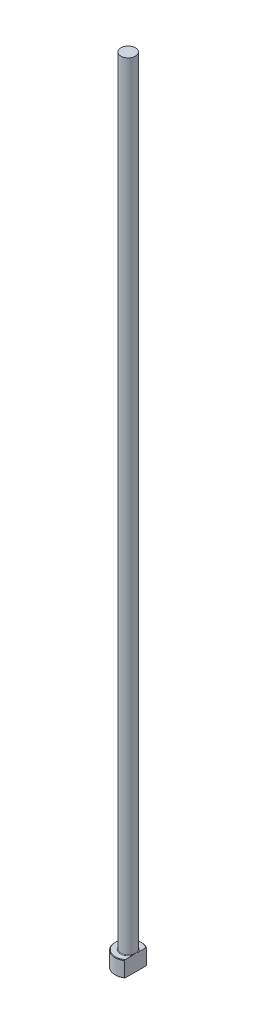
ISO-10303-21;
HEADER;
FILE_DESCRIPTION(('STEP AP214'),'2;1');
FILE_NAME('part.step','',(''),(''),'','','');
FILE_SCHEMA(('AUTOMOTIVE_DESIGN { 1 0 10303 214 1 1 1 1 }'));
ENDSEC;
DATA;
#1=APPLICATION_CONTEXT('core data for automotive mechanical design processes');
#2=APPLICATION_PROTOCOL_DEFINITION('international standard','automotive_design',2000,#1);
#3=PRODUCT_CONTEXT('',#1,'mechanical');
#4=PRODUCT('Part','Part','',(#3));
#5=PRODUCT_RELATED_PRODUCT_CATEGORY('part','',(#4));
#6=PRODUCT_DEFINITION_FORMATION('','',#4);
#7=PRODUCT_DEFINITION_CONTEXT('part definition',#1,'design');
#8=PRODUCT_DEFINITION('design','',#6,#7);
#9=PRODUCT_DEFINITION_SHAPE('','',#8);
#10=(LENGTH_UNIT() NAMED_UNIT(*) SI_UNIT(.MILLI.,.METRE.));
#11=(NAMED_UNIT(*) PLANE_ANGLE_UNIT() SI_UNIT($,.RADIAN.));
#12=(NAMED_UNIT(*) SI_UNIT($,.STERADIAN.) SOLID_ANGLE_UNIT());
#13=UNCERTAINTY_MEASURE_WITH_UNIT(LENGTH_MEASURE(1.E-05),#10,'distance_accuracy_value','');
#14=(GEOMETRIC_REPRESENTATION_CONTEXT(3) GLOBAL_UNCERTAINTY_ASSIGNED_CONTEXT((#13)) GLOBAL_UNIT_ASSIGNED_CONTEXT((#10,
#11,#12)) REPRESENTATION_CONTEXT('',''));
#15=CARTESIAN_POINT('',(0.,0.,0.));
#16=DIRECTION('',(0.,0.,1.));
#17=DIRECTION('',(1.,0.,0.));
#18=AXIS2_PLACEMENT_3D('',#15,#16,#17);
#19=CARTESIAN_POINT('',(0.,0.,0.));
#20=DIRECTION('',(0.,-1.,0.));
#21=DIRECTION('',(0.,0.,-1.));
#22=AXIS2_PLACEMENT_3D('',#19,#20,#21);
#23=PLANE('',#22);
#24=CARTESIAN_POINT('',(0.,0.,0.));
#25=DIRECTION('',(0.,-1.,0.));
#26=DIRECTION('',(0.,0.,-1.));
#27=AXIS2_PLACEMENT_3D('',#24,#25,#26);
#28=CIRCLE('',#27,4.79999999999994);
#29=CARTESIAN_POINT('',(2.74999999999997,0.,3.93414539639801));
#30=VERTEX_POINT('',#29);
#31=CARTESIAN_POINT('',(2.74999999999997,0.,-3.93414539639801));
#32=VERTEX_POINT('',#31);
#33=EDGE_CURVE('E98',#30,#32,#28,.T.);
#34=ORIENTED_EDGE('',*,*,#33,.T.);
#35=DIRECTION('',(0.,0.,1.));
#36=VECTOR('',#35,1.);
#37=CARTESIAN_POINT('',(2.74999999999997,0.,4.1758232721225));
#38=LINE('',#37,#36);
#39=EDGE_CURVE('E83',#32,#30,#38,.T.);
#40=ORIENTED_EDGE('',*,*,#39,.T.);
#41=EDGE_LOOP('',(#34,#40));
#42=FACE_BOUND('',#41,.T.);
#43=ADVANCED_FACE('F32',(#42),#23,.T.);
#44=CARTESIAN_POINT('',(0.,259.958771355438,0.));
#45=DIRECTION('',(0.,1.,0.));
#46=DIRECTION('',(0.,0.,1.));
#47=AXIS2_PLACEMENT_3D('',#44,#45,#46);
#48=CYLINDRICAL_SURFACE('',#47,4.99999999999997);
#49=CARTESIAN_POINT('',(0.,5.79999999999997,0.));
#50=DIRECTION('',(0.,1.,0.));
#51=DIRECTION('',(0.,0.,1.));
#52=AXIS2_PLACEMENT_3D('',#49,#50,#51);
#53=CIRCLE('',#52,4.99999999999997);
#54=CARTESIAN_POINT('',(2.74999999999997,5.79999999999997,4.1758232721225));
#55=VERTEX_POINT('',#54);
#56=CARTESIAN_POINT('',(2.74999999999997,5.79999999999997,-4.1758232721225));
#57=VERTEX_POINT('',#56);
#58=EDGE_CURVE('E104',#55,#57,#53,.F.);
#59=ORIENTED_EDGE('',*,*,#58,.T.);
#60=DIRECTION('',(0.,-1.,0.));
#61=VECTOR('',#60,1.);
#62=CARTESIAN_POINT('',(2.74999999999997,300.,-4.1758232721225));
#63=LINE('',#62,#61);
#64=CARTESIAN_POINT('',(2.74999999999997,0.200000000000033,-4.1758232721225));
#65=VERTEX_POINT('',#64);
#66=EDGE_CURVE('E183',#57,#65,#63,.T.);
#67=ORIENTED_EDGE('',*,*,#66,.T.);
#68=CARTESIAN_POINT('',(0.,0.200000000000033,0.));
#69=DIRECTION('',(0.,-1.,0.));
#70=DIRECTION('',(0.,0.,-1.));
#71=AXIS2_PLACEMENT_3D('',#68,#69,#70);
#72=CIRCLE('',#71,4.99999999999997);
#73=CARTESIAN_POINT('',(2.74999999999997,0.200000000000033,4.1758232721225));
#74=VERTEX_POINT('',#73);
#75=EDGE_CURVE('E100',#65,#74,#72,.F.);
#76=ORIENTED_EDGE('',*,*,#75,.T.);
#77=DIRECTION('',(0.,-1.,0.));
#78=VECTOR('',#77,1.);
#79=CARTESIAN_POINT('',(2.74999999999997,300.,4.1758232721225));
#80=LINE('',#79,#78);
#81=EDGE_CURVE('E93',#55,#74,#80,.T.);
#82=ORIENTED_EDGE('',*,*,#81,.F.);
#83=EDGE_LOOP('',(#59,#67,#76,#82));
#84=FACE_BOUND('',#83,.T.);
#85=ADVANCED_FACE('F158',(#84),#48,.T.);
#86=CARTESIAN_POINT('',(-4.99999999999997,6.,0.));
#87=DIRECTION('',(0.,1.,0.));
#88=DIRECTION('',(0.,0.,1.));
#89=AXIS2_PLACEMENT_3D('',#86,#87,#88);
#90=PLANE('',#89);
#91=CARTESIAN_POINT('',(0.,6.,0.));
#92=DIRECTION('',(0.,1.,0.));
#93=DIRECTION('',(0.,0.,1.));
#94=AXIS2_PLACEMENT_3D('',#91,#92,#93);
#95=CIRCLE('',#94,4.79999999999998);
#96=CARTESIAN_POINT('',(2.74999999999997,6.,-3.93414539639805));
#97=VERTEX_POINT('',#96);
#98=CARTESIAN_POINT('',(2.74999999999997,6.,3.93414539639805));
#99=VERTEX_POINT('',#98);
#100=EDGE_CURVE('E178',#97,#99,#95,.T.);
#101=ORIENTED_EDGE('',*,*,#100,.T.);
#102=DIRECTION('',(0.,0.,-1.));
#103=VECTOR('',#102,1.);
#104=CARTESIAN_POINT('',(2.74999999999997,6.,0.));
#105=LINE('',#104,#103);
#106=CARTESIAN_POINT('',(2.74999999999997,5.99999999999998,1.06770782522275));
#107=VERTEX_POINT('',#106);
#108=EDGE_CURVE('E57',#99,#107,#105,.T.);
#109=ORIENTED_EDGE('',*,*,#108,.T.);
#110=CARTESIAN_POINT('',(0.,6.,0.));
#111=DIRECTION('',(0.,1.,0.));
#112=DIRECTION('',(0.,0.,1.));
#113=AXIS2_PLACEMENT_3D('',#110,#111,#112);
#114=CIRCLE('',#113,2.94999999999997);
#115=CARTESIAN_POINT('',(2.74999999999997,5.99999999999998,-1.06770782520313));
#116=VERTEX_POINT('',#115);
#117=EDGE_CURVE('E107',#107,#116,#114,.F.);
#118=ORIENTED_EDGE('',*,*,#117,.T.);
#119=EDGE_CURVE('E136',#116,#97,#105,.T.);
#120=ORIENTED_EDGE('',*,*,#119,.T.);
#121=EDGE_LOOP('',(#101,#109,#118,#120));
#122=FACE_BOUND('',#121,.T.);
#123=ADVANCED_FACE('F147',(#122),#90,.T.);
#124=CARTESIAN_POINT('',(0.,6.00000000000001,0.));
#125=DIRECTION('',(0.,-1.,0.));
#126=DIRECTION('',(0.,0.,-1.));
#127=AXIS2_PLACEMENT_3D('',#124,#125,#126);
#128=CONICAL_SURFACE('',#127,4.79999999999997,0.785398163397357);
#129=ORIENTED_EDGE('',*,*,#58,.F.);
#130=CARTESIAN_POINT('',(2.74999999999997,1.20885441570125,9.18844783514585));
#131=CARTESIAN_POINT('',(2.74999999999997,1.37523675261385,9.01476898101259));
#132=CARTESIAN_POINT('',(2.74999999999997,1.54142180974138,8.84090089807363));
#133=CARTESIAN_POINT('',(2.74999999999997,1.8733122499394,8.49270511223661));
#134=CARTESIAN_POINT('',(2.74999999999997,2.0390176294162,8.3183774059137));
#135=CARTESIAN_POINT('',(2.74999999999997,2.5353674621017,7.79449769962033));
#136=CARTESIAN_POINT('',(2.74999999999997,2.86516041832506,7.44413786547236));
#137=CARTESIAN_POINT('',(2.74999999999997,3.52140645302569,6.74030951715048));
#138=CARTESIAN_POINT('',(2.74999999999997,3.84785962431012,6.38684108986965));
#139=CARTESIAN_POINT('',(2.74999999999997,4.3335393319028,5.85303151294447));
#140=CARTESIAN_POINT('',(2.74999999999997,4.49475728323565,5.674503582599));
#141=CARTESIAN_POINT('',(2.74999999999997,4.81545552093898,5.31589537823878));
#142=CARTESIAN_POINT('',(2.74999999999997,4.97493583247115,5.13581512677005));
#143=CARTESIAN_POINT('',(2.74999999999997,5.28246157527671,4.78409714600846));
#144=CARTESIAN_POINT('',(2.74999999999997,5.43063567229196,4.61257212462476));
#145=CARTESIAN_POINT('',(2.74999999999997,5.72427023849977,4.26717959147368));
#146=CARTESIAN_POINT('',(2.74999999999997,5.86973045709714,4.09331186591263));
#147=CARTESIAN_POINT('',(2.74999999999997,6.15716227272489,3.74214491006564));
#148=CARTESIAN_POINT('',(2.74999999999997,6.29912659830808,3.56483970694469));
#149=CARTESIAN_POINT('',(2.74999999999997,6.57763983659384,3.20603939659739));
#150=CARTESIAN_POINT('',(2.74999999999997,6.7141898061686,3.02454511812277));
#151=CARTESIAN_POINT('',(2.74999999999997,6.93857405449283,2.71219163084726));
#152=CARTESIAN_POINT('',(2.74999999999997,7.02851673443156,2.58285434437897));
#153=CARTESIAN_POINT('',(2.74999999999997,7.20308451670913,2.32054245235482));
#154=CARTESIAN_POINT('',(2.74999999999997,7.28770764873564,2.18756652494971));
#155=CARTESIAN_POINT('',(2.74999999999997,7.44931959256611,1.91735675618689));
#156=CARTESIAN_POINT('',(2.74999999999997,7.5263237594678,1.78013224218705));
#157=CARTESIAN_POINT('',(2.74999999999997,7.66966790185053,1.5003132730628));
#158=CARTESIAN_POINT('',(2.74999999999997,7.73601725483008,1.35772367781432));
#159=CARTESIAN_POINT('',(2.74999999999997,7.86065113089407,1.04856386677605));
#160=CARTESIAN_POINT('',(2.74999999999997,7.91700799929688,0.881171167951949));
#161=CARTESIAN_POINT('',(2.74999999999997,7.98102802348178,0.625229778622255));
#162=CARTESIAN_POINT('',(2.74999999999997,7.9989381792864,0.539229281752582));
#163=CARTESIAN_POINT('',(2.74999999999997,8.0270715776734,0.365959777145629));
#164=CARTESIAN_POINT('',(2.74999999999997,8.03729562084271,0.278690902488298));
#165=CARTESIAN_POINT('',(2.74999999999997,8.04949232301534,0.10276389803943));
#166=CARTESIAN_POINT('',(2.74999999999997,8.0513883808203,0.0141003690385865));
#167=CARTESIAN_POINT('',(2.74999999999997,8.04659669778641,-0.162990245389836));
#168=CARTESIAN_POINT('',(2.74999999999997,8.03990892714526,-0.251417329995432));
#169=CARTESIAN_POINT('',(2.74999999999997,8.01835539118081,-0.427430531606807));
#170=CARTESIAN_POINT('',(2.74999999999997,8.00347341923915,-0.515014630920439));
#171=CARTESIAN_POINT('',(2.74999999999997,7.96636720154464,-0.688602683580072));
#172=CARTESIAN_POINT('',(2.74999999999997,7.94414138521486,-0.774606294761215));
#173=CARTESIAN_POINT('',(2.74999999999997,7.88037969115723,-0.988315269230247));
#174=CARTESIAN_POINT('',(2.74999999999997,7.83478497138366,-1.11480587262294));
#175=CARTESIAN_POINT('',(2.74999999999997,7.73271903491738,-1.36329985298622));
#176=CARTESIAN_POINT('',(2.74999999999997,7.67623944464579,-1.4852996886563));
#177=CARTESIAN_POINT('',(2.74999999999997,7.55498227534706,-1.72582737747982));
#178=CARTESIAN_POINT('',(2.74999999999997,7.49016436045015,-1.84433466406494));
#179=CARTESIAN_POINT('',(2.74999999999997,7.38849038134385,-2.01944141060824));
#180=CARTESIAN_POINT('',(2.74999999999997,7.35386385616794,-2.07735876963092));
#181=CARTESIAN_POINT('',(2.74999999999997,7.28331846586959,-2.19239883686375));
#182=CARTESIAN_POINT('',(2.74999999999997,7.24739965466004,-2.24952157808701));
#183=CARTESIAN_POINT('',(2.74999999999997,7.12488368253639,-2.4401926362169));
#184=CARTESIAN_POINT('',(2.74999999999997,7.03574833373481,-2.57211125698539));
#185=CARTESIAN_POINT('',(2.74999999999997,6.85300432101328,-2.83282496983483));
#186=CARTESIAN_POINT('',(2.74999999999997,6.75939460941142,-2.96161931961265));
#187=CARTESIAN_POINT('',(2.74999999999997,6.56878484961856,-3.2168121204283));
#188=CARTESIAN_POINT('',(2.74999999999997,6.47178237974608,-3.34320875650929));
#189=CARTESIAN_POINT('',(2.74999999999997,6.27524323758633,-3.59402090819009));
#190=CARTESIAN_POINT('',(2.74999999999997,6.17570641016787,-3.71843630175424));
#191=CARTESIAN_POINT('',(2.74999999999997,5.97442282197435,-3.96596722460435));
#192=CARTESIAN_POINT('',(2.74999999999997,5.87267126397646,-4.08907884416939));
#193=CARTESIAN_POINT('',(2.74999999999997,5.66760125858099,-4.3339916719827));
#194=CARTESIAN_POINT('',(2.74999999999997,5.56428277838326,-4.45579285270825));
#195=CARTESIAN_POINT('',(2.74999999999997,5.2525502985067,-4.81947940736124));
#196=CARTESIAN_POINT('',(2.74999999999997,5.04226620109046,-5.05976099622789));
#197=CARTESIAN_POINT('',(2.74999999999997,4.61812846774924,-5.53760543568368));
#198=CARTESIAN_POINT('',(2.74999999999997,4.40427119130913,-5.77516503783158));
#199=CARTESIAN_POINT('',(2.74999999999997,3.97415714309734,-6.2481438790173));
#200=CARTESIAN_POINT('',(2.74999999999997,3.75790012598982,-6.48356289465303));
#201=CARTESIAN_POINT('',(2.74999999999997,3.32391192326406,-6.95249982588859));
#202=CARTESIAN_POINT('',(2.74999999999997,3.10618287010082,-7.18601971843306));
#203=CARTESIAN_POINT('',(2.74999999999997,2.6694128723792,-7.65182952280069));
#204=CARTESIAN_POINT('',(2.74999999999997,2.45037192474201,-7.88411943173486));
#205=CARTESIAN_POINT('',(2.74999999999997,2.14586495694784,-8.2056307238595));
#206=CARTESIAN_POINT('',(2.74999999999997,2.06083046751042,-8.2952613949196));
#207=CARTESIAN_POINT('',(2.74999999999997,1.89060889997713,-8.47440444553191));
#208=CARTESIAN_POINT('',(2.74999999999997,1.80542180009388,-8.56391680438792));
#209=CARTESIAN_POINT('',(2.74999999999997,1.63506457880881,-8.74266965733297));
#210=CARTESIAN_POINT('',(2.74999999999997,1.54989467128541,-8.83191035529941));
#211=CARTESIAN_POINT('',(2.74999999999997,1.37945223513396,-9.01026683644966));
#212=CARTESIAN_POINT('',(2.74999999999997,1.29417972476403,-9.09938263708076));
#213=CARTESIAN_POINT('',(2.74999999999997,1.20885441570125,-9.18844783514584));
#214=B_SPLINE_CURVE_WITH_KNOTS('',3,(#130,#131,#132,#133,#134,#135,#136,#137,#138,#139,#140,
#141,#142,#143,#144,#145,#146,#147,#148,#149,#150,#151,#152,#153,#154,#155,#156,#157,#158,#159,
#160,#161,#162,#163,#164,#165,#166,#167,#168,#169,#170,#171,#172,#173,#174,#175,#176,#177,#178,
#179,#180,#181,#182,#183,#184,#185,#186,#187,#188,#189,#190,#191,#192,#193,#194,#195,#196,#197,
#198,#199,#200,#201,#202,#203,#204,#205,#206,#207,#208,#209,#210,#211,#212,#213),.UNSPECIFIED.,
.F.,.F.,(4,2,2,2,2,2,2,2,2,2,2,2,2,2,2,2,2,2,2,2,2,2,2,2,2,2,2,2,2,2,2,2,2,2,2,2,2,2,2,2,2,4),
(0.,0.721544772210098,1.4430949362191,2.88656432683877,4.32999349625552,5.05163004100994,
5.77325612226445,6.45322671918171,7.13325979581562,7.81460476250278,8.49581607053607,
8.96833065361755,9.44101923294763,9.91273488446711,10.3840330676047,10.9119743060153,
11.1752192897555,11.4384368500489,11.704070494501,11.9697050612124,12.2358669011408,
12.5020857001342,12.9047274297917,13.3076801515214,13.7126610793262,13.9150857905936,
14.1175020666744,14.5949844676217,15.0725792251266,15.5505221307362,16.0284943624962,
16.5076321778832,16.9867800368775,17.9446362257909,18.9035363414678,19.8625354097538,
20.8203587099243,21.7781842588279,22.1488332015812,22.5195401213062,22.8896215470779,
23.2596447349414),.UNSPECIFIED.);
#215=EDGE_CURVE('E135',#55,#99,#214,.T.);
#216=ORIENTED_EDGE('',*,*,#215,.T.);
#217=ORIENTED_EDGE('',*,*,#100,.F.);
#218=EDGE_CURVE('E127',#97,#57,#214,.T.);
#219=ORIENTED_EDGE('',*,*,#218,.T.);
#220=EDGE_LOOP('',(#129,#216,#217,#219));
#221=FACE_BOUND('',#220,.T.);
#222=ADVANCED_FACE('F143',(#221),#128,.T.);
#223=CARTESIAN_POINT('',(0.,0.200000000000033,0.));
#224=DIRECTION('',(0.,1.,0.));
#225=DIRECTION('',(0.,0.,1.));
#226=AXIS2_PLACEMENT_3D('',#223,#224,#225);
#227=CONICAL_SURFACE('',#226,4.99999999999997,0.785398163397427);
#228=ORIENTED_EDGE('',*,*,#75,.F.);
#229=CARTESIAN_POINT('',(2.74999999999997,4.79114558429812,-9.18844783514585));
#230=CARTESIAN_POINT('',(2.74999999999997,4.62476324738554,-9.01476898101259));
#231=CARTESIAN_POINT('',(2.74999999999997,4.45857819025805,-8.84090089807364));
#232=CARTESIAN_POINT('',(2.74999999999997,4.12668775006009,-8.49270511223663));
#233=CARTESIAN_POINT('',(2.74999999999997,3.96098237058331,-8.31837740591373));
#234=CARTESIAN_POINT('',(2.74999999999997,3.4646325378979,-7.79449769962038));
#235=CARTESIAN_POINT('',(2.74999999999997,3.1348395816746,-7.44413786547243));
#236=CARTESIAN_POINT('',(2.74999999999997,2.47859354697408,-6.74030951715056));
#237=CARTESIAN_POINT('',(2.74999999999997,2.1521403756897,-6.38684108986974));
#238=CARTESIAN_POINT('',(2.74999999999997,1.66646066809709,-5.85303151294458));
#239=CARTESIAN_POINT('',(2.74999999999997,1.50524271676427,-5.67450358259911));
#240=CARTESIAN_POINT('',(2.74999999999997,1.184544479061,-5.3158953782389));
#241=CARTESIAN_POINT('',(2.74999999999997,1.02506416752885,-5.13581512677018));
#242=CARTESIAN_POINT('',(2.74999999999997,0.717538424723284,-4.78409714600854));
#243=CARTESIAN_POINT('',(2.74999999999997,0.569364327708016,-4.61257212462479));
#244=CARTESIAN_POINT('',(2.74999999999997,0.275729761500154,-4.2671795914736));
#245=CARTESIAN_POINT('',(2.74999999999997,0.130269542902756,-4.09331186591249));
#246=CARTESIAN_POINT('',(2.74999999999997,-0.157162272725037,-3.74214491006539));
#247=CARTESIAN_POINT('',(2.74999999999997,-0.299126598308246,-3.56483970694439));
#248=CARTESIAN_POINT('',(2.74999999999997,-0.577639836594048,-3.20603939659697));
#249=CARTESIAN_POINT('',(2.74999999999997,-0.714189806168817,-3.02454511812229));
#250=CARTESIAN_POINT('',(2.74999999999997,-0.938574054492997,-2.71219163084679));
#251=CARTESIAN_POINT('',(2.74999999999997,-1.02851673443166,-2.58285434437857));
#252=CARTESIAN_POINT('',(2.74999999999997,-1.2030845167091,-2.32054245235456));
#253=CARTESIAN_POINT('',(2.74999999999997,-1.28770764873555,-2.18756652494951));
#254=CARTESIAN_POINT('',(2.74999999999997,-1.4493195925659,-1.91735675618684));
#255=CARTESIAN_POINT('',(2.74999999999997,-1.52632375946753,-1.78013224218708));
#256=CARTESIAN_POINT('',(2.74999999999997,-1.66966790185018,-1.50031327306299));
#257=CARTESIAN_POINT('',(2.74999999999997,-1.73601725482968,-1.35772367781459));
#258=CARTESIAN_POINT('',(2.74999999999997,-1.86065113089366,-1.04856386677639));
#259=CARTESIAN_POINT('',(2.74999999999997,-1.91700799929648,-0.881171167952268));
#260=CARTESIAN_POINT('',(2.74999999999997,-1.98102802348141,-0.625229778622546));
#261=CARTESIAN_POINT('',(2.74999999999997,-1.99893817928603,-0.539229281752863));
#262=CARTESIAN_POINT('',(2.74999999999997,-2.02707157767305,-0.36595977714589));
#263=CARTESIAN_POINT('',(2.74999999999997,-2.03729562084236,-0.278690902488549));
#264=CARTESIAN_POINT('',(2.74999999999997,-2.04949232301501,-0.102763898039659));
#265=CARTESIAN_POINT('',(2.74999999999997,-2.05138838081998,-0.014100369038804));
#266=CARTESIAN_POINT('',(2.74999999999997,-2.04659669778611,0.162990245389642));
#267=CARTESIAN_POINT('',(2.74999999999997,-2.03990892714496,0.25141732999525));
#268=CARTESIAN_POINT('',(2.74999999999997,-2.01835539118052,0.42743053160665));
#269=CARTESIAN_POINT('',(2.74999999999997,-2.00347341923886,0.515014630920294));
#270=CARTESIAN_POINT('',(2.74999999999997,-1.96636720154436,0.688602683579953));
#271=CARTESIAN_POINT('',(2.74999999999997,-1.94414138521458,0.774606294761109));
#272=CARTESIAN_POINT('',(2.74999999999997,-1.88037969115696,0.988315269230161));
#273=CARTESIAN_POINT('',(2.74999999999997,-1.8347849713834,1.11480587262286));
#274=CARTESIAN_POINT('',(2.74999999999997,-1.73271903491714,1.36329985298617));
#275=CARTESIAN_POINT('',(2.74999999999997,-1.67623944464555,1.48529968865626));
#276=CARTESIAN_POINT('',(2.74999999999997,-1.55498227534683,1.72582737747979));
#277=CARTESIAN_POINT('',(2.74999999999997,-1.49016436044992,1.84433466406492));
#278=CARTESIAN_POINT('',(2.74999999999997,-1.38849038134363,2.01944141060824));
#279=CARTESIAN_POINT('',(2.74999999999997,-1.35386385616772,2.07735876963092));
#280=CARTESIAN_POINT('',(2.74999999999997,-1.28331846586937,2.19239883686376));
#281=CARTESIAN_POINT('',(2.74999999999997,-1.24739965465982,2.24952157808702));
#282=CARTESIAN_POINT('',(2.74999999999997,-1.12488368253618,2.44019263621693));
#283=CARTESIAN_POINT('',(2.74999999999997,-1.03574833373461,2.57211125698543));
#284=CARTESIAN_POINT('',(2.74999999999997,-0.853004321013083,2.83282496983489));
#285=CARTESIAN_POINT('',(2.74999999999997,-0.759394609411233,2.96161931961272));
#286=CARTESIAN_POINT('',(2.74999999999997,-0.568784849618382,3.21681212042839));
#287=CARTESIAN_POINT('',(2.74999999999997,-0.471782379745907,3.34320875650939));
#288=CARTESIAN_POINT('',(2.74999999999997,-0.275243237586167,3.59402090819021));
#289=CARTESIAN_POINT('',(2.74999999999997,-0.175706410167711,3.71843630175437));
#290=CARTESIAN_POINT('',(2.74999999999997,0.025577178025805,3.9659672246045));
#291=CARTESIAN_POINT('',(2.74999999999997,0.127328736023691,4.08907884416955));
#292=CARTESIAN_POINT('',(2.74999999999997,0.332398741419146,4.33399167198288));
#293=CARTESIAN_POINT('',(2.74999999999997,0.435717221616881,4.45579285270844));
#294=CARTESIAN_POINT('',(2.74999999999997,0.747449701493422,4.81947940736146));
#295=CARTESIAN_POINT('',(2.74999999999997,0.957733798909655,5.05976099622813));
#296=CARTESIAN_POINT('',(2.74999999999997,1.38187153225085,5.53760543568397));
#297=CARTESIAN_POINT('',(2.74999999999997,1.59572880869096,5.77516503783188));
#298=CARTESIAN_POINT('',(2.74999999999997,2.02584285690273,6.24814387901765));
#299=CARTESIAN_POINT('',(2.74999999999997,2.24209987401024,6.4835628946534));
#300=CARTESIAN_POINT('',(2.74999999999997,2.67608807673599,6.952499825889));
#301=CARTESIAN_POINT('',(2.74999999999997,2.89381712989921,7.1860197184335));
#302=CARTESIAN_POINT('',(2.74999999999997,3.33058712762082,7.65182952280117));
#303=CARTESIAN_POINT('',(2.74999999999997,3.549628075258,7.88411943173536));
#304=CARTESIAN_POINT('',(2.74999999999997,3.85413504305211,8.20563072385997));
#305=CARTESIAN_POINT('',(2.74999999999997,3.93916953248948,8.29526139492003));
#306=CARTESIAN_POINT('',(2.74999999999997,4.10939110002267,8.47440444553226));
#307=CARTESIAN_POINT('',(2.74999999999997,4.19457819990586,8.56391680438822));
#308=CARTESIAN_POINT('',(2.74999999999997,4.36493542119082,8.74266965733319));
#309=CARTESIAN_POINT('',(2.74999999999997,4.45010532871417,8.83191035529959));
#310=CARTESIAN_POINT('',(2.74999999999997,4.62054776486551,9.01026683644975));
#311=CARTESIAN_POINT('',(2.74999999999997,4.70582027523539,9.0993826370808));
#312=CARTESIAN_POINT('',(2.74999999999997,4.79114558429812,9.18844783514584));
#313=B_SPLINE_CURVE_WITH_KNOTS('',3,(#229,#230,#231,#232,#233,#234,#235,#236,#237,#238,#239,
#240,#241,#242,#243,#244,#245,#246,#247,#248,#249,#250,#251,#252,#253,#254,#255,#256,#257,#258,
#259,#260,#261,#262,#263,#264,#265,#266,#267,#268,#269,#270,#271,#272,#273,#274,#275,#276,#277,
#278,#279,#280,#281,#282,#283,#284,#285,#286,#287,#288,#289,#290,#291,#292,#293,#294,#295,#296,
#297,#298,#299,#300,#301,#302,#303,#304,#305,#306,#307,#308,#309,#310,#311,#312),.UNSPECIFIED.,
.F.,.F.,(4,2,2,2,2,2,2,2,2,2,2,2,2,2,2,2,2,2,2,2,2,2,2,2,2,2,2,2,2,2,2,2,2,2,2,2,2,2,2,2,2,4),
(0.,0.721544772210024,1.44309493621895,2.88656432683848,4.3299934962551,5.05163004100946,
5.77325612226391,6.45322671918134,7.13325979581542,7.81460476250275,8.49581607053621,
8.96833065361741,9.44101923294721,9.91273488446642,10.3840330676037,10.9119743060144,
11.1752192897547,11.438436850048,11.7040704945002,11.9697050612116,12.2358669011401,
12.5020857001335,12.9047274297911,13.3076801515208,13.7126610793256,13.915085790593,
14.1175020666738,14.5949844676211,15.072579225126,15.5505221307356,16.0284943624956,
16.5076321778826,16.986780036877,17.9446362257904,18.9035363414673,19.8625354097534,
20.8203587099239,21.7781842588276,22.1488332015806,22.5195401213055,22.889621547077,
23.2596447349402),.UNSPECIFIED.);
#314=EDGE_CURVE('E86',#65,#32,#313,.T.);
#315=ORIENTED_EDGE('',*,*,#314,.T.);
#316=ORIENTED_EDGE('',*,*,#33,.F.);
#317=EDGE_CURVE('E89',#30,#74,#313,.T.);
#318=ORIENTED_EDGE('',*,*,#317,.T.);
#319=EDGE_LOOP('',(#228,#315,#316,#318));
#320=FACE_BOUND('',#319,.T.);
#321=ADVANCED_FACE('F97',(#320),#227,.T.);
#322=CARTESIAN_POINT('',(0.,6.19999999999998,0.));
#323=DIRECTION('',(0.,1.,0.));
#324=DIRECTION('',(0.,0.,1.));
#325=AXIS2_PLACEMENT_3D('',#322,#323,#324);
#326=TOROIDAL_SURFACE('',#325,2.94999999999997,0.2);
#327=CARTESIAN_POINT('',(2.74999999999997,6.19999999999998,0.));
#328=CARTESIAN_POINT('',(2.74999999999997,6.20000050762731,1.12997204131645E-10));
#329=CARTESIAN_POINT('',(2.74999999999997,6.20000101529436,-1.81527538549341E-07));
#330=CARTESIAN_POINT('',(2.74999999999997,6.20000196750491,-6.94840321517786E-07));
#331=CARTESIAN_POINT('',(2.74999999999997,6.20000240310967,-1.03787719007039E-06));
#332=CARTESIAN_POINT('',(2.74999999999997,6.2000033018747,-1.85808129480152E-06));
#333=CARTESIAN_POINT('',(2.74999999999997,6.20000375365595,-2.34835983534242E-06));
#334=CARTESIAN_POINT('',(2.74999999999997,6.20000456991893,-3.37046961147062E-06));
#335=CARTESIAN_POINT('',(2.74999999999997,6.20000493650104,-3.90074161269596E-06));
#336=CARTESIAN_POINT('',(2.74999999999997,6.20000627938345,-5.9326173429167E-06));
#337=CARTESIAN_POINT('',(2.74999999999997,6.20000718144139,-7.48563177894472E-06));
#338=CARTESIAN_POINT('',(2.74999999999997,6.20000868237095,-1.05790083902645E-05));
#339=CARTESIAN_POINT('',(2.74999999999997,6.20000929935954,-1.21109700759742E-05));
#340=CARTESIAN_POINT('',(2.74999999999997,6.20001185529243,-1.85322193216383E-05));
#341=CARTESIAN_POINT('',(2.74999999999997,6.20001373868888,-2.34472712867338E-05));
#342=CARTESIAN_POINT('',(2.74999999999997,6.20001654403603,-3.27779453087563E-05));
#343=CARTESIAN_POINT('',(2.74999999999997,6.20001756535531,-3.71636224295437E-05));
#344=CARTESIAN_POINT('',(2.74999999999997,6.20002495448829,-6.95743734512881E-05));
#345=CARTESIAN_POINT('',(2.74999999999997,6.20003050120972,-9.77394526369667E-05));
#346=CARTESIAN_POINT('',(2.74999999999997,6.2000547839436,-0.000208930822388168));
#347=CARTESIAN_POINT('',(2.74999999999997,6.20007801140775,-0.000290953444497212));
#348=CARTESIAN_POINT('',(2.74999999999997,6.20016837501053,-0.00061567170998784));
#349=CARTESIAN_POINT('',(2.74999999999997,6.20023256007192,-0.000858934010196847));
#350=CARTESIAN_POINT('',(2.74999999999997,6.20048946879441,-0.00182516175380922));
#351=CARTESIAN_POINT('',(2.74999999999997,6.20068588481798,-0.00254739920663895));
#352=CARTESIAN_POINT('',(2.74999999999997,6.20150145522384,-0.00555461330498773));
#353=CARTESIAN_POINT('',(2.74999999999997,6.20211597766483,-0.00784050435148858));
#354=CARTESIAN_POINT('',(2.74999999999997,6.20754641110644,-0.0280301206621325));
#355=CARTESIAN_POINT('',(2.74999999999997,6.21238054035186,-0.0459303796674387));
#356=CARTESIAN_POINT('',(2.74999999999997,6.22182435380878,-0.0810299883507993));
#357=CARTESIAN_POINT('',(2.74999999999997,6.22643534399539,-0.0982290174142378));
#358=CARTESIAN_POINT('',(2.74999999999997,6.23620184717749,-0.134808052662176));
#359=CARTESIAN_POINT('',(2.74999999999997,6.24135263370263,-0.154189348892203));
#360=CARTESIAN_POINT('',(2.74999999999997,6.25163624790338,-0.193181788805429));
#361=CARTESIAN_POINT('',(2.74999999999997,6.25676827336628,-0.212793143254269));
#362=CARTESIAN_POINT('',(2.74999999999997,6.26905119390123,-0.260223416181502));
#363=CARTESIAN_POINT('',(2.74999999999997,6.27615177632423,-0.288055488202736));
#364=CARTESIAN_POINT('',(2.74999999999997,6.28988618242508,-0.343037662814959));
#365=CARTESIAN_POINT('',(2.74999999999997,6.29652742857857,-0.37018592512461));
#366=CARTESIAN_POINT('',(2.74999999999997,6.31791197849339,-0.460013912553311));
#367=CARTESIAN_POINT('',(2.74999999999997,6.33192996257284,-0.522872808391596));
#368=CARTESIAN_POINT('',(2.74999999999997,6.35724782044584,-0.649858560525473));
#369=CARTESIAN_POINT('',(2.74999999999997,6.36851625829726,-0.71399176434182));
#370=CARTESIAN_POINT('',(2.74999999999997,6.38744836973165,-0.848144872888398));
#371=CARTESIAN_POINT('',(2.74999999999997,6.39474814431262,-0.918222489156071));
#372=CARTESIAN_POINT('',(2.74999999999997,6.39971832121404,-1.02344881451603));
#373=CARTESIAN_POINT('',(2.74999999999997,6.40038441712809,-1.05845158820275));
#374=CARTESIAN_POINT('',(2.74999999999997,6.39917295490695,-1.1284044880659));
#375=CARTESIAN_POINT('',(2.74999999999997,6.39729798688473,-1.16335463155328));
#376=CARTESIAN_POINT('',(2.74999999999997,6.39199994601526,-1.21505383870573));
#377=CARTESIAN_POINT('',(2.74999999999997,6.38986571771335,-1.23193598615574));
#378=CARTESIAN_POINT('',(2.74999999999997,6.38464996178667,-1.2655715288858));
#379=CARTESIAN_POINT('',(2.74999999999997,6.38156766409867,-1.28232480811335));
#380=CARTESIAN_POINT('',(2.74999999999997,6.37431364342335,-1.31540767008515));
#381=CARTESIAN_POINT('',(2.74999999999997,6.37015411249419,-1.33173987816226));
#382=CARTESIAN_POINT('',(2.74999999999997,6.36048976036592,-1.36399299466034));
#383=CARTESIAN_POINT('',(2.74999999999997,6.35498646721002,-1.37991434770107));
#384=CARTESIAN_POINT('',(2.74999999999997,6.34222746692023,-1.41123903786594));
#385=CARTESIAN_POINT('',(2.74999999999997,6.33495457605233,-1.42663549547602));
#386=CARTESIAN_POINT('',(2.74999999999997,6.318175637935,-1.45617471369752));
#387=CARTESIAN_POINT('',(2.74999999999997,6.30867792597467,-1.4703218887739));
#388=CARTESIAN_POINT('',(2.74999999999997,6.29277007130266,-1.48907990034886));
#389=CARTESIAN_POINT('',(2.74999999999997,6.2875192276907,-1.49466894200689));
#390=CARTESIAN_POINT('',(2.74999999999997,6.27634440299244,-1.50515028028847));
#391=CARTESIAN_POINT('',(2.74999999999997,6.27042002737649,-1.51004216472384));
#392=CARTESIAN_POINT('',(2.74999999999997,6.25778482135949,-1.51891099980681));
#393=CARTESIAN_POINT('',(2.74999999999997,6.2510643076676,-1.52287446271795));
#394=CARTESIAN_POINT('',(2.74999999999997,6.23698143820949,-1.52941740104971));
#395=CARTESIAN_POINT('',(2.74999999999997,6.22962116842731,-1.53200119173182));
#396=CARTESIAN_POINT('',(2.74999999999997,6.2166326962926,-1.53496289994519));
#397=CARTESIAN_POINT('',(2.74999999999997,6.2110985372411,-1.53575651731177));
#398=CARTESIAN_POINT('',(2.74999999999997,6.19997558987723,-1.53638738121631));
#399=CARTESIAN_POINT('',(2.74999999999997,6.19438682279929,-1.53622498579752));
#400=CARTESIAN_POINT('',(2.74999999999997,6.18332943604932,-1.53495937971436));
#401=CARTESIAN_POINT('',(2.74999999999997,6.17786061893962,-1.53385785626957));
#402=CARTESIAN_POINT('',(2.74999999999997,6.16716525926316,-1.53080991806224));
#403=CARTESIAN_POINT('',(2.74999999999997,6.16193889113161,-1.52886290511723));
#404=CARTESIAN_POINT('',(2.74999999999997,6.14983366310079,-1.52335528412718));
#405=CARTESIAN_POINT('',(2.74999999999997,6.14310699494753,-1.51946144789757));
#406=CARTESIAN_POINT('',(2.74999999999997,6.13035821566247,-1.51065443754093));
#407=CARTESIAN_POINT('',(2.74999999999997,6.12433789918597,-1.5057387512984));
#408=CARTESIAN_POINT('',(2.74999999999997,6.10956608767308,-1.4920109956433));
#409=CARTESIAN_POINT('',(2.74999999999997,6.10134587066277,-1.48263193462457));
#410=CARTESIAN_POINT('',(2.74999999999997,6.08638427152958,-1.46278796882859));
#411=CARTESIAN_POINT('',(2.74999999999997,6.07964511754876,-1.45232146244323));
#412=CARTESIAN_POINT('',(2.74999999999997,6.06171675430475,-1.42080727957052));
#413=CARTESIAN_POINT('',(2.74999999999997,6.05211924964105,-1.39886385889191));
#414=CARTESIAN_POINT('',(2.74999999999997,6.03592584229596,-1.35377597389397));
#415=CARTESIAN_POINT('',(2.74999999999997,6.02935693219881,-1.33062268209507));
#416=CARTESIAN_POINT('',(2.74999999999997,6.01641276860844,-1.27469229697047));
#417=CARTESIAN_POINT('',(2.74999999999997,6.01110503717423,-1.24167224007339));
#418=CARTESIAN_POINT('',(2.74999999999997,6.00364182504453,-1.17522319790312));
#419=CARTESIAN_POINT('',(2.74999999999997,6.00149608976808,-1.1417932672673));
#420=CARTESIAN_POINT('',(2.74999999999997,5.99965905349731,-1.07618467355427));
#421=CARTESIAN_POINT('',(2.74999999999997,5.9998750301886,-1.04400821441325));
#422=CARTESIAN_POINT('',(2.74999999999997,6.00208041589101,-0.979705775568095));
#423=CARTESIAN_POINT('',(2.74999999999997,6.0040708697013,-0.947579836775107));
#424=CARTESIAN_POINT('',(2.74999999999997,6.01231998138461,-0.849711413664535));
#425=CARTESIAN_POINT('',(2.74999999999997,6.02086596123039,-0.784164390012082));
#426=CARTESIAN_POINT('',(2.74999999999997,6.04217753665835,-0.652153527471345));
#427=CARTESIAN_POINT('',(2.74999999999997,6.05504187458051,-0.585706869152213));
#428=CARTESIAN_POINT('',(2.74999999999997,6.07899589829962,-0.474257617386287));
#429=CARTESIAN_POINT('',(2.74999999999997,6.0893670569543,-0.429096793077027));
#430=CARTESIAN_POINT('',(2.74999999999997,6.11088695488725,-0.339494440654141));
#431=CARTESIAN_POINT('',(2.74999999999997,6.12202574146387,-0.295050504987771));
#432=CARTESIAN_POINT('',(2.74999999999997,6.1435522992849,-0.211341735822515));
#433=CARTESIAN_POINT('',(2.74999999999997,6.15388178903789,-0.172061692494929));
#434=CARTESIAN_POINT('',(2.74999999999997,6.17523671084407,-0.0918970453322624));
#435=CARTESIAN_POINT('',(2.74999999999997,6.18627305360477,-0.0510152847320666));
#436=CARTESIAN_POINT('',(2.74999999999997,6.19788514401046,-0.00783595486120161));
#437=CARTESIAN_POINT('',(2.74999999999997,6.19850096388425,-0.00554554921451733));
#438=CARTESIAN_POINT('',(2.74999999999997,6.19931683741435,-0.00253730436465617));
#439=CARTESIAN_POINT('',(2.74999999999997,6.19951229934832,-0.00181855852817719));
#440=CARTESIAN_POINT('',(2.74999999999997,6.19976804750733,-0.000856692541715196));
#441=CARTESIAN_POINT('',(2.74999999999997,6.19983200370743,-0.00061429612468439));
#442=CARTESIAN_POINT('',(2.74999999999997,6.19992209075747,-0.000290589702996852));
#443=CARTESIAN_POINT('',(2.74999999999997,6.19994527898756,-0.000208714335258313));
#444=CARTESIAN_POINT('',(2.74999999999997,6.1999695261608,-9.76928431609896E-05));
#445=CARTESIAN_POINT('',(2.74999999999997,6.19997506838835,-6.95486159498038E-05));
#446=CARTESIAN_POINT('',(2.74999999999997,6.19998244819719,-3.71590916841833E-05));
#447=CARTESIAN_POINT('',(2.74999999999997,6.19998346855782,-3.27745922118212E-05));
#448=CARTESIAN_POINT('',(2.74999999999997,6.19998627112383,-2.34463159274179E-05));
#449=CARTESIAN_POINT('',(2.74999999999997,6.19998815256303,-1.85324215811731E-05));
#450=CARTESIAN_POINT('',(2.74999999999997,6.19999070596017,-1.21123670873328E-05));
#451=CARTESIAN_POINT('',(2.74999999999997,6.19999132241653,-1.05804935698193E-05));
#452=CARTESIAN_POINT('',(2.74999999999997,6.19999282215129,-7.48720406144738E-06));
#453=CARTESIAN_POINT('',(2.74999999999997,6.19999372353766,-5.93417788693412E-06));
#454=CARTESIAN_POINT('',(2.74999999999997,6.1999950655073,-3.90218207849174E-06));
#455=CARTESIAN_POINT('',(2.74999999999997,6.19999543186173,-3.37185002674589E-06));
#456=CARTESIAN_POINT('',(2.74999999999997,6.19999624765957,-2.34957905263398E-06));
#457=CARTESIAN_POINT('',(2.74999999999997,6.19999669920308,-1.8591980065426E-06));
#458=CARTESIAN_POINT('',(2.74999999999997,6.19999759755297,-1.03875219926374E-06));
#459=CARTESIAN_POINT('',(2.74999999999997,6.19999803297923,-6.95584904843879E-07));
#460=CARTESIAN_POINT('',(2.74999999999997,6.19999898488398,-1.81944082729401E-07));
#461=CARTESIAN_POINT('',(2.74999999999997,6.19999949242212,-1.12986192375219E-10));
#462=CARTESIAN_POINT('',(2.74999999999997,6.19999999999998,0.));
#463=B_SPLINE_CURVE_WITH_KNOTS('',3,(#327,#328,#329,#330,#331,#332,#333,#334,#335,#336,#337,
#338,#339,#340,#341,#342,#343,#344,#345,#346,#347,#348,#349,#350,#351,#352,#353,#354,#355,#356,
#357,#358,#359,#360,#361,#362,#363,#364,#365,#366,#367,#368,#369,#370,#371,#372,#373,#374,#375,
#376,#377,#378,#379,#380,#381,#382,#383,#384,#385,#386,#387,#388,#389,#390,#391,#392,#393,#394,
#395,#396,#397,#398,#399,#400,#401,#402,#403,#404,#405,#406,#407,#408,#409,#410,#411,#412,#413,
#414,#415,#416,#417,#418,#419,#420,#421,#422,#423,#424,#425,#426,#427,#428,#429,#430,#431,#432,
#433,#434,#435,#436,#437,#438,#439,#440,#441,#442,#443,#444,#445,#446,#447,#448,#449,#450,#451,
#452,#453,#454,#455,#456,#457,#458,#459,#460,#461,#462),.UNSPECIFIED.,.T.,.F.,(4,2,2,2,2,2,2,2,
2,2,2,2,2,2,2,2,2,2,2,2,2,2,2,2,2,2,2,2,2,2,2,2,2,2,2,2,2,2,2,2,2,2,2,2,2,2,2,2,2,2,2,2,2,2,2,2,
2,2,2,2,2,2,2,2,2,2,2,4),(0.,1.53302756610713E-06,3.19538918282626E-06,5.18410383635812E-06,
7.11680689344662E-06,1.24843263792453E-05,1.74346119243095E-05,3.31954282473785E-05,
4.66876451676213E-05,0.000132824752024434,0.000388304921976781,0.00114333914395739,
0.00338841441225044,0.0104899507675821,0.0661127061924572,0.119532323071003,0.179694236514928,
0.240509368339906,0.3266784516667,0.41052476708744,0.603684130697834,0.798958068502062,
1.00997653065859,1.1149423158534,1.2198011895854,1.27083021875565,1.32190080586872,
1.37241688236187,1.42287578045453,1.47384571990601,1.52462767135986,1.54758745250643,
1.57056075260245,1.59384955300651,1.61706507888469,1.6337610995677,1.65045086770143,
1.66711071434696,1.68378236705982,1.70696786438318,1.73021104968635,1.76741395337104,
1.80467244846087,1.87612299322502,1.94819858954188,2.04828679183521,2.14868283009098,
2.24515187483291,2.34167775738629,2.53976637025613,2.74273377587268,2.88173187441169,
3.0191810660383,3.1410275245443,3.26805859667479,3.27517420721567,3.27740842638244,
3.27816077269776,3.27841579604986,3.27850186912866,3.27851535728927,3.27853111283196,
3.27853606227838,3.27854142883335,3.27854336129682,3.27854534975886,3.27854701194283,
3.278548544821),.UNSPECIFIED.);
#464=CARTESIAN_POINT('',(2.74999999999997,6.19999999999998,0.));
#465=VERTEX_POINT('',#464);
#466=EDGE_CURVE('E11',#116,#465,#463,.T.);
#467=ORIENTED_EDGE('',*,*,#466,.F.);
#468=ORIENTED_EDGE('',*,*,#117,.F.);
#469=CARTESIAN_POINT('',(2.74999999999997,6.19999999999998,0.));
#470=CARTESIAN_POINT('',(2.74999999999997,6.19999949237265,-1.12997140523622E-10));
#471=CARTESIAN_POINT('',(2.74999999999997,6.1999989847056,1.81527538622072E-07));
#472=CARTESIAN_POINT('',(2.74999999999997,6.19999803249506,6.94840321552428E-07));
#473=CARTESIAN_POINT('',(2.74999999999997,6.1999975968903,1.03787719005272E-06));
#474=CARTESIAN_POINT('',(2.74999999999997,6.19999669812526,1.85808129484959E-06));
#475=CARTESIAN_POINT('',(2.74999999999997,6.19999624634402,2.34835983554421E-06));
#476=CARTESIAN_POINT('',(2.74999999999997,6.19999543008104,3.37046961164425E-06));
#477=CARTESIAN_POINT('',(2.74999999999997,6.19999506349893,3.90074161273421E-06));
#478=CARTESIAN_POINT('',(2.74999999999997,6.19999372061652,5.93261734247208E-06));
#479=CARTESIAN_POINT('',(2.74999999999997,6.19999281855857,7.48563177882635E-06));
#480=CARTESIAN_POINT('',(2.74999999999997,6.19999131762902,1.05790083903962E-05));
#481=CARTESIAN_POINT('',(2.74999999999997,6.19999070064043,1.21109700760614E-05));
#482=CARTESIAN_POINT('',(2.74999999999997,6.19998814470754,1.85322193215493E-05));
#483=CARTESIAN_POINT('',(2.74999999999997,6.19998626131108,2.34472712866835E-05));
#484=CARTESIAN_POINT('',(2.74999999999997,6.19998345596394,3.27779453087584E-05));
#485=CARTESIAN_POINT('',(2.74999999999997,6.19998243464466,3.71636224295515E-05));
#486=CARTESIAN_POINT('',(2.74999999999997,6.19997504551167,6.95743734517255E-05));
#487=CARTESIAN_POINT('',(2.74999999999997,6.19996949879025,9.77394526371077E-05));
#488=CARTESIAN_POINT('',(2.74999999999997,6.19994521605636,0.000208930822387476));
#489=CARTESIAN_POINT('',(2.74999999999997,6.19992198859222,0.000290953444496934));
#490=CARTESIAN_POINT('',(2.74999999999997,6.19983162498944,0.000615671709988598));
#491=CARTESIAN_POINT('',(2.74999999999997,6.19976743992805,0.000858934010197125));
#492=CARTESIAN_POINT('',(2.74999999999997,6.19951053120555,0.00182516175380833));
#493=CARTESIAN_POINT('',(2.74999999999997,6.19931411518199,0.00254739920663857));
#494=CARTESIAN_POINT('',(2.74999999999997,6.19849854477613,0.00555461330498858));
#495=CARTESIAN_POINT('',(2.74999999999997,6.19788402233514,0.00784050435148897));
#496=CARTESIAN_POINT('',(2.74999999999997,6.19245358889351,0.0280301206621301));
#497=CARTESIAN_POINT('',(2.74999999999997,6.1876194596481,0.0459303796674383));
#498=CARTESIAN_POINT('',(2.74999999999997,6.17817564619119,0.0810299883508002));
#499=CARTESIAN_POINT('',(2.74999999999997,6.17356465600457,0.0982290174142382));
#500=CARTESIAN_POINT('',(2.74999999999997,6.16379815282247,0.134808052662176));
#501=CARTESIAN_POINT('',(2.74999999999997,6.15864736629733,0.154189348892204));
#502=CARTESIAN_POINT('',(2.74999999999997,6.14836375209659,0.19318178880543));
#503=CARTESIAN_POINT('',(2.74999999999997,6.14323172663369,0.21279314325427));
#504=CARTESIAN_POINT('',(2.74999999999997,6.13094880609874,0.260223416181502));
#505=CARTESIAN_POINT('',(2.74999999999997,6.12384822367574,0.288055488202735));
#506=CARTESIAN_POINT('',(2.74999999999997,6.11011381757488,0.343037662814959));
#507=CARTESIAN_POINT('',(2.74999999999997,6.10347257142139,0.37018592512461));
#508=CARTESIAN_POINT('',(2.74999999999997,6.08208802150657,0.460013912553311));
#509=CARTESIAN_POINT('',(2.74999999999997,6.06807003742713,0.522872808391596));
#510=CARTESIAN_POINT('',(2.74999999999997,6.04275217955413,0.649858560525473));
#511=CARTESIAN_POINT('',(2.74999999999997,6.03148374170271,0.71399176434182));
#512=CARTESIAN_POINT('',(2.74999999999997,6.01255163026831,0.848144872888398));
#513=CARTESIAN_POINT('',(2.74999999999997,6.00525185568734,0.918222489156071));
#514=CARTESIAN_POINT('',(2.74999999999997,6.00028167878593,1.02344881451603));
#515=CARTESIAN_POINT('',(2.74999999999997,5.99961558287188,1.05845158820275));
#516=CARTESIAN_POINT('',(2.74999999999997,6.00082704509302,1.1284044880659));
#517=CARTESIAN_POINT('',(2.74999999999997,6.00270201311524,1.16335463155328));
#518=CARTESIAN_POINT('',(2.74999999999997,6.00800005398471,1.21505383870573));
#519=CARTESIAN_POINT('',(2.74999999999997,6.01013428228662,1.23193598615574));
#520=CARTESIAN_POINT('',(2.74999999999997,6.0153500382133,1.2655715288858));
#521=CARTESIAN_POINT('',(2.74999999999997,6.0184323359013,1.28232480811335));
#522=CARTESIAN_POINT('',(2.74999999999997,6.02568635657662,1.31540767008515));
#523=CARTESIAN_POINT('',(2.74999999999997,6.02984588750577,1.33173987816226));
#524=CARTESIAN_POINT('',(2.74999999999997,6.03951023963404,1.36399299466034));
#525=CARTESIAN_POINT('',(2.74999999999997,6.04501353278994,1.37991434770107));
#526=CARTESIAN_POINT('',(2.74999999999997,6.05777253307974,1.41123903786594));
#527=CARTESIAN_POINT('',(2.74999999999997,6.06504542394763,1.42663549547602));
#528=CARTESIAN_POINT('',(2.74999999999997,6.08182436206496,1.45617471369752));
#529=CARTESIAN_POINT('',(2.74999999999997,6.09132207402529,1.4703218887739));
#530=CARTESIAN_POINT('',(2.74999999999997,6.10722992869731,1.48907990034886));
#531=CARTESIAN_POINT('',(2.74999999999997,6.11248077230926,1.49466894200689));
#532=CARTESIAN_POINT('',(2.74999999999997,6.12365559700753,1.50515028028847));
#533=CARTESIAN_POINT('',(2.74999999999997,6.12957997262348,1.51004216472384));
#534=CARTESIAN_POINT('',(2.74999999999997,6.14221517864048,1.51891099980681));
#535=CARTESIAN_POINT('',(2.74999999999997,6.14893569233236,1.52287446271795));
#536=CARTESIAN_POINT('',(2.74999999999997,6.16301856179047,1.52941740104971));
#537=CARTESIAN_POINT('',(2.74999999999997,6.17037883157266,1.53200119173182));
#538=CARTESIAN_POINT('',(2.74999999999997,6.18336730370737,1.53496289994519));
#539=CARTESIAN_POINT('',(2.74999999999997,6.18890146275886,1.53575651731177));
#540=CARTESIAN_POINT('',(2.74999999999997,6.20002441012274,1.53638738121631));
#541=CARTESIAN_POINT('',(2.74999999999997,6.20561317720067,1.53622498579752));
#542=CARTESIAN_POINT('',(2.74999999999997,6.21667056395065,1.53495937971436));
#543=CARTESIAN_POINT('',(2.74999999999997,6.22213938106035,1.53385785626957));
#544=CARTESIAN_POINT('',(2.74999999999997,6.23283474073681,1.53080991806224));
#545=CARTESIAN_POINT('',(2.74999999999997,6.23806110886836,1.52886290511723));
#546=CARTESIAN_POINT('',(2.74999999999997,6.25016633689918,1.52335528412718));
#547=CARTESIAN_POINT('',(2.74999999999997,6.25689300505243,1.51946144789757));
#548=CARTESIAN_POINT('',(2.74999999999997,6.26964178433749,1.51065443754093));
#549=CARTESIAN_POINT('',(2.74999999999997,6.275662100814,1.5057387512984));
#550=CARTESIAN_POINT('',(2.74999999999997,6.29043391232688,1.4920109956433));
#551=CARTESIAN_POINT('',(2.74999999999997,6.2986541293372,1.48263193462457));
#552=CARTESIAN_POINT('',(2.74999999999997,6.31361572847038,1.46278796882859));
#553=CARTESIAN_POINT('',(2.74999999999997,6.32035488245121,1.45232146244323));
#554=CARTESIAN_POINT('',(2.74999999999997,6.33828324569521,1.42080727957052));
#555=CARTESIAN_POINT('',(2.74999999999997,6.34788075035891,1.39886385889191));
#556=CARTESIAN_POINT('',(2.74999999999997,6.364074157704,1.35377597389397));
#557=CARTESIAN_POINT('',(2.74999999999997,6.37064306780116,1.33062268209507));
#558=CARTESIAN_POINT('',(2.74999999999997,6.38358723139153,1.27469229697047));
#559=CARTESIAN_POINT('',(2.74999999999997,6.38889496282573,1.24167224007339));
#560=CARTESIAN_POINT('',(2.74999999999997,6.39635817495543,1.17522319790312));
#561=CARTESIAN_POINT('',(2.74999999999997,6.39850391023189,1.1417932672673));
#562=CARTESIAN_POINT('',(2.74999999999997,6.40034094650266,1.07618467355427));
#563=CARTESIAN_POINT('',(2.74999999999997,6.40012496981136,1.04400821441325));
#564=CARTESIAN_POINT('',(2.74999999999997,6.39791958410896,0.979705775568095));
#565=CARTESIAN_POINT('',(2.74999999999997,6.39592913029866,0.947579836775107));
#566=CARTESIAN_POINT('',(2.74999999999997,6.38768001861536,0.849711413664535));
#567=CARTESIAN_POINT('',(2.74999999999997,6.37913403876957,0.784164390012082));
#568=CARTESIAN_POINT('',(2.74999999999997,6.35782246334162,0.652153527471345));
#569=CARTESIAN_POINT('',(2.74999999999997,6.34495812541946,0.585706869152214));
#570=CARTESIAN_POINT('',(2.74999999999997,6.32100410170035,0.474257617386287));
#571=CARTESIAN_POINT('',(2.74999999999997,6.31063294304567,0.429096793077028));
#572=CARTESIAN_POINT('',(2.74999999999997,6.28911304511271,0.339494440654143));
#573=CARTESIAN_POINT('',(2.74999999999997,6.2779742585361,0.295050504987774));
#574=CARTESIAN_POINT('',(2.74999999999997,6.25644770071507,0.211341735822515));
#575=CARTESIAN_POINT('',(2.74999999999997,6.24611821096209,0.172061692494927));
#576=CARTESIAN_POINT('',(2.74999999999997,6.22476328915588,0.0918970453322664));
#577=CARTESIAN_POINT('',(2.74999999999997,6.21372694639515,0.0510152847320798));
#578=CARTESIAN_POINT('',(2.74999999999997,6.20211485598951,0.00783595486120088));
#579=CARTESIAN_POINT('',(2.74999999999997,6.20149903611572,0.0055455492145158));
#580=CARTESIAN_POINT('',(2.74999999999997,6.20068316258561,0.00253730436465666));
#581=CARTESIAN_POINT('',(2.74999999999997,6.20048770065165,0.0018185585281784));
#582=CARTESIAN_POINT('',(2.74999999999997,6.20023195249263,0.000856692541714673));
#583=CARTESIAN_POINT('',(2.74999999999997,6.20016799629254,0.000614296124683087));
#584=CARTESIAN_POINT('',(2.74999999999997,6.2000779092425,0.000290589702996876));
#585=CARTESIAN_POINT('',(2.74999999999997,6.20005472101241,0.000208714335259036));
#586=CARTESIAN_POINT('',(2.74999999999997,6.20003047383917,9.76928431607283E-05));
#587=CARTESIAN_POINT('',(2.74999999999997,6.20002493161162,6.95486159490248E-05));
#588=CARTESIAN_POINT('',(2.74999999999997,6.20001755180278,3.7159091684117E-05));
#589=CARTESIAN_POINT('',(2.74999999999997,6.20001653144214,3.27745922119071E-05));
#590=CARTESIAN_POINT('',(2.74999999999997,6.20001372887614,2.34463159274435E-05));
#591=CARTESIAN_POINT('',(2.74999999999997,6.20001184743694,1.85324215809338E-05));
#592=CARTESIAN_POINT('',(2.74999999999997,6.2000092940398,1.21123670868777E-05));
#593=CARTESIAN_POINT('',(2.74999999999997,6.20000867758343,1.05804935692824E-05));
#594=CARTESIAN_POINT('',(2.74999999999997,6.20000717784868,7.48720406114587E-06));
#595=CARTESIAN_POINT('',(2.74999999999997,6.2000062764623,5.93417788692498E-06));
#596=CARTESIAN_POINT('',(2.74999999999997,6.20000493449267,3.90218207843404E-06));
#597=CARTESIAN_POINT('',(2.74999999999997,6.20000456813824,3.37185002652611E-06));
#598=CARTESIAN_POINT('',(2.74999999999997,6.2000037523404,2.34957905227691E-06));
#599=CARTESIAN_POINT('',(2.74999999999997,6.20000330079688,1.85919800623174E-06));
#600=CARTESIAN_POINT('',(2.74999999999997,6.200002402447,1.03875219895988E-06));
#601=CARTESIAN_POINT('',(2.74999999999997,6.20000196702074,6.95584904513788E-07));
#602=CARTESIAN_POINT('',(2.74999999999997,6.20000101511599,1.8194408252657E-07));
#603=CARTESIAN_POINT('',(2.74999999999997,6.20000050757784,1.12986128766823E-10));
#604=CARTESIAN_POINT('',(2.74999999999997,6.19999999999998,0.));
#605=B_SPLINE_CURVE_WITH_KNOTS('',3,(#469,#470,#471,#472,#473,#474,#475,#476,#477,#478,#479,
#480,#481,#482,#483,#484,#485,#486,#487,#488,#489,#490,#491,#492,#493,#494,#495,#496,#497,#498,
#499,#500,#501,#502,#503,#504,#505,#506,#507,#508,#509,#510,#511,#512,#513,#514,#515,#516,#517,
#518,#519,#520,#521,#522,#523,#524,#525,#526,#527,#528,#529,#530,#531,#532,#533,#534,#535,#536,
#537,#538,#539,#540,#541,#542,#543,#544,#545,#546,#547,#548,#549,#550,#551,#552,#553,#554,#555,
#556,#557,#558,#559,#560,#561,#562,#563,#564,#565,#566,#567,#568,#569,#570,#571,#572,#573,#574,
#575,#576,#577,#578,#579,#580,#581,#582,#583,#584,#585,#586,#587,#588,#589,#590,#591,#592,#593,
#594,#595,#596,#597,#598,#599,#600,#601,#602,#603,#604),.UNSPECIFIED.,.T.,.F.,(4,2,2,2,2,2,2,2,
2,2,2,2,2,2,2,2,2,2,2,2,2,2,2,2,2,2,2,2,2,2,2,2,2,2,2,2,2,2,2,2,2,2,2,2,2,2,2,2,2,2,2,2,2,2,2,2,
2,2,2,2,2,2,2,2,2,2,2,4),(0.,1.5330275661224E-06,3.19538918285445E-06,5.18410383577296E-06,
7.11680689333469E-06,1.24843263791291E-05,1.74346119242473E-05,3.31954282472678E-05,
4.66876451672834E-05,0.000132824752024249,0.000388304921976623,0.00114333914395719,
0.00338841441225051,0.010489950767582,0.0661127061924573,0.119532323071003,0.179694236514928,
0.240509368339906,0.3266784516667,0.41052476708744,0.603684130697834,0.798958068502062,
1.00997653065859,1.1149423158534,1.2198011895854,1.27083021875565,1.32190080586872,
1.37241688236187,1.42287578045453,1.47384571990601,1.52462767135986,1.54758745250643,
1.57056075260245,1.59384955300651,1.61706507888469,1.6337610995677,1.65045086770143,
1.66711071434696,1.68378236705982,1.70696786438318,1.73021104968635,1.76741395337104,
1.80467244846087,1.87612299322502,1.94819858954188,2.04828679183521,2.14868283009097,
2.24515187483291,2.34167775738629,2.53976637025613,2.74273377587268,2.88173187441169,
3.0191810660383,3.1410275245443,3.26805859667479,3.27517420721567,3.27740842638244,
3.27816077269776,3.27841579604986,3.27850186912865,3.27851535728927,3.27853111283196,
3.27853606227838,3.27854142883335,3.27854336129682,3.27854534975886,3.27854701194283,
3.278548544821),.UNSPECIFIED.);
#606=EDGE_CURVE('E46',#465,#107,#605,.T.);
#607=ORIENTED_EDGE('',*,*,#606,.F.);
#608=CARTESIAN_POINT('',(0.,6.19999999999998,0.));
#609=DIRECTION('',(0.,1.,0.));
#610=DIRECTION('',(0.,0.,1.));
#611=AXIS2_PLACEMENT_3D('',#608,#609,#610);
#612=CIRCLE('',#611,2.74999999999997);
#613=EDGE_CURVE('E103',#465,#465,#612,.T.);
#614=ORIENTED_EDGE('',*,*,#613,.F.);
#615=EDGE_LOOP('',(#467,#468,#607,#614));
#616=FACE_BOUND('',#615,.T.);
#617=ADVANCED_FACE('F34',(#616),#326,.F.);
#618=CARTESIAN_POINT('',(0.,259.958771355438,0.));
#619=DIRECTION('',(0.,1.,0.));
#620=DIRECTION('',(0.,0.,1.));
#621=AXIS2_PLACEMENT_3D('',#618,#619,#620);
#622=CYLINDRICAL_SURFACE('',#621,2.74999999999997);
#623=ORIENTED_EDGE('',*,*,#613,.T.);
#624=EDGE_LOOP('',(#623));
#625=FACE_BOUND('',#624,.T.);
#626=CARTESIAN_POINT('',(0.,300.,0.));
#627=DIRECTION('',(0.,1.,0.));
#628=DIRECTION('',(0.,0.,1.));
#629=AXIS2_PLACEMENT_3D('',#626,#627,#628);
#630=CIRCLE('',#629,2.74999999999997);
#631=CARTESIAN_POINT('',(0.,300.,2.74999999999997));
#632=VERTEX_POINT('',#631);
#633=EDGE_CURVE('E101',#632,#632,#630,.T.);
#634=ORIENTED_EDGE('',*,*,#633,.F.);
#635=EDGE_LOOP('',(#634));
#636=FACE_BOUND('',#635,.T.);
#637=ADVANCED_FACE('F155',(#625,#636),#622,.T.);
#638=CARTESIAN_POINT('',(-2.74999999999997,300.,0.));
#639=DIRECTION('',(0.,1.,0.));
#640=DIRECTION('',(0.,0.,1.));
#641=AXIS2_PLACEMENT_3D('',#638,#639,#640);
#642=PLANE('',#641);
#643=ORIENTED_EDGE('',*,*,#633,.T.);
#644=EDGE_LOOP('',(#643));
#645=FACE_BOUND('',#644,.T.);
#646=ADVANCED_FACE('F121',(#645),#642,.T.);
#647=CARTESIAN_POINT('',(2.74999999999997,300.,4.1758232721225));
#648=DIRECTION('',(1.,0.,0.));
#649=DIRECTION('',(0.,0.,-1.));
#650=AXIS2_PLACEMENT_3D('',#647,#648,#649);
#651=PLANE('',#650);
#652=ORIENTED_EDGE('',*,*,#66,.F.);
#653=ORIENTED_EDGE('',*,*,#218,.F.);
#654=ORIENTED_EDGE('',*,*,#119,.F.);
#655=ORIENTED_EDGE('',*,*,#466,.T.);
#656=ORIENTED_EDGE('',*,*,#606,.T.);
#657=ORIENTED_EDGE('',*,*,#108,.F.);
#658=ORIENTED_EDGE('',*,*,#215,.F.);
#659=ORIENTED_EDGE('',*,*,#81,.T.);
#660=ORIENTED_EDGE('',*,*,#317,.F.);
#661=ORIENTED_EDGE('',*,*,#39,.F.);
#662=ORIENTED_EDGE('',*,*,#314,.F.);
#663=EDGE_LOOP('',(#652,#653,#654,#655,#656,#657,#658,#659,#660,#661,#662));
#664=FACE_BOUND('',#663,.T.);
#665=ADVANCED_FACE('F85',(#664),#651,.T.);
#666=CLOSED_SHELL('',(#43,#85,#123,#222,#321,#617,#637,#646,#665));
#667=MANIFOLD_SOLID_BREP('B2',#666);
#668=ADVANCED_BREP_SHAPE_REPRESENTATION('',(#18,#667),#14);
#669=SHAPE_DEFINITION_REPRESENTATION(#9,#668);
ENDSEC;
END-ISO-10303-21;
